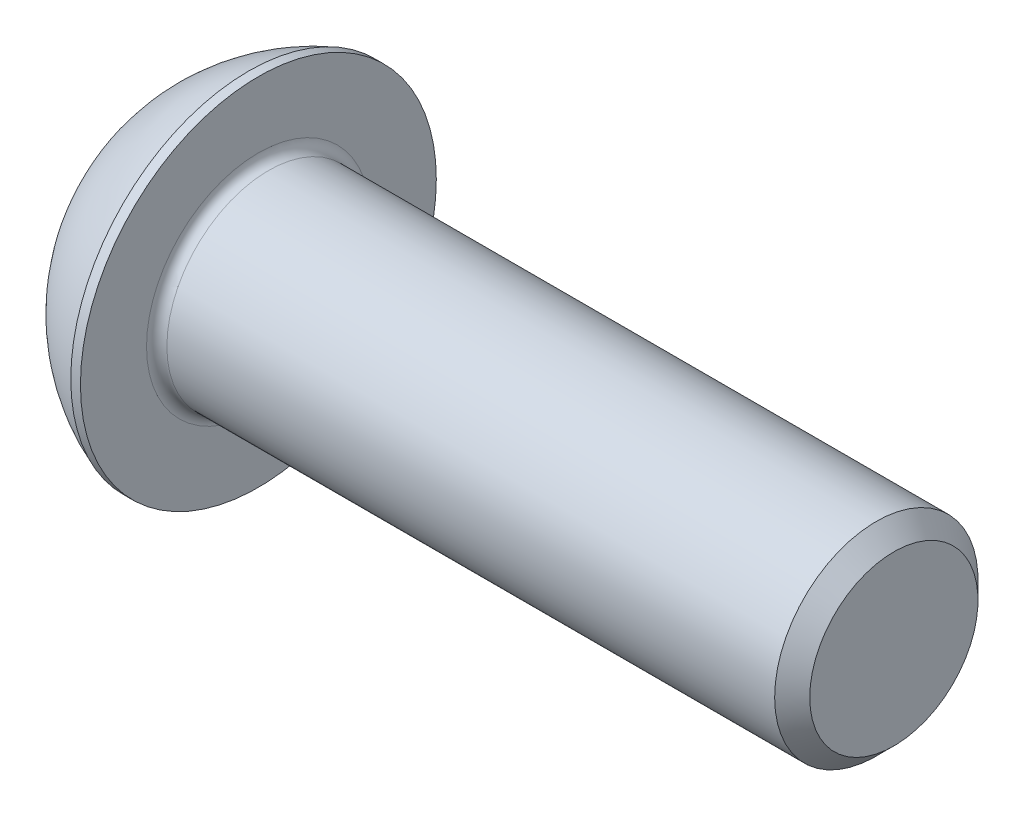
from build123d import *

# Parameters (mm, degrees)
FILLET1_R   = 0.4
HEX_2_DEPTH = 2.6


with BuildPart() as part:
    # BodySke → BaseBody (revolve)
    with BuildSketch(Plane.XY, mode=Mode.PRIVATE) as basebody_sk:
        with BuildLine():
            Line((29.4, 0), (29.4, 3.3095))
            Line((29.4, 3.3095), (28.7095, 4))
            Line((28.7095, 4), (4.4, 4))
            Line((4.4, 4), (4.4, 7))
            Line((4.4, 7), (4.02, 7))
            ThreePointArc((4.02, 7), (1.686451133, 5.621618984), (0, 3.5))
            Line((0, 3.5), (0, 0))
            Line((0, 0), (29.4, 0))
        make_face()
    revolve(basebody_sk.sketch.rotate(Axis((0, 0, 0), (1, 0, 0)), 90), axis=Axis((0, 0, 0), (1, 0, 0)))

    # Fillet1
    fillet1_edges = [part.edges().sort_by_distance(p)[0] for p in [
        (4.4, 0, -4),
    ]]
    fillet(fillet1_edges, radius=FILLET1_R)

    # Sketch2 → PreBroach (revolve, cut)
    with BuildSketch(Plane.XY, mode=Mode.PRIVATE) as prebroach_sk:
        Polygon((0, 2.5), (2.6, 2.5), (4.043375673, 0), (0, 0), align=None)
    revolve(prebroach_sk.sketch.rotate(Axis((0, 0, 0), (1, 0, 0)), 90), axis=Axis((0, 0, 0), (1, 0, 0)), mode=Mode.SUBTRACT)

    # Sketch3 → Hex 2 (cut)
    with BuildSketch(Plane(origin=(0, 0, 0), x_dir=(0, 0, -1), z_dir=(1, 0, 0))):
        Polygon((-2.5, -1.443375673), (-2.5, 1.443375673), (0, 2.886751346), (2.5, 1.443375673), (2.5, -1.443375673), (0, -2.886751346), align=None)
    extrude(amount=HEX_2_DEPTH, mode=Mode.SUBTRACT)


solid = part.part
